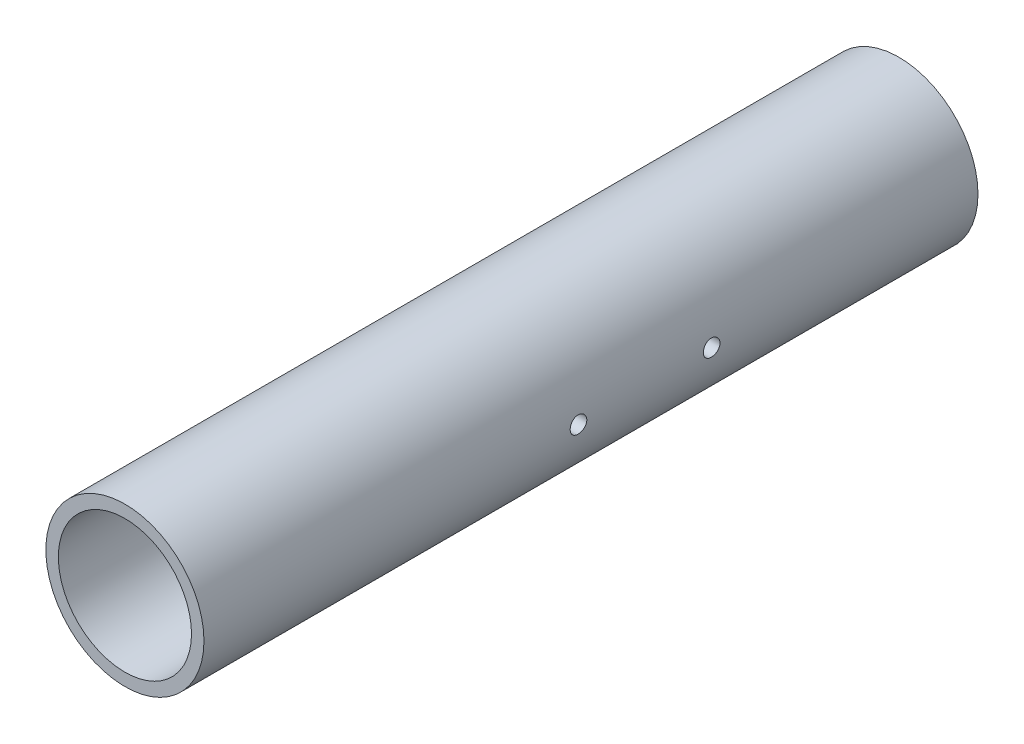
ISO-10303-21;
HEADER;
FILE_DESCRIPTION(('STEP AP214'),'2;1');
FILE_NAME('part.step','',(''),(''),'','','');
FILE_SCHEMA(('AUTOMOTIVE_DESIGN { 1 0 10303 214 1 1 1 1 }'));
ENDSEC;
DATA;
#1=APPLICATION_CONTEXT('core data for automotive mechanical design processes');
#2=APPLICATION_PROTOCOL_DEFINITION('international standard','automotive_design',2000,#1);
#3=PRODUCT_CONTEXT('',#1,'mechanical');
#4=PRODUCT('Part','Part','',(#3));
#5=PRODUCT_RELATED_PRODUCT_CATEGORY('part','',(#4));
#6=PRODUCT_DEFINITION_FORMATION('','',#4);
#7=PRODUCT_DEFINITION_CONTEXT('part definition',#1,'design');
#8=PRODUCT_DEFINITION('design','',#6,#7);
#9=PRODUCT_DEFINITION_SHAPE('','',#8);
#10=(LENGTH_UNIT() NAMED_UNIT(*) SI_UNIT(.MILLI.,.METRE.));
#11=(NAMED_UNIT(*) PLANE_ANGLE_UNIT() SI_UNIT($,.RADIAN.));
#12=(NAMED_UNIT(*) SI_UNIT($,.STERADIAN.) SOLID_ANGLE_UNIT());
#13=UNCERTAINTY_MEASURE_WITH_UNIT(LENGTH_MEASURE(1.E-05),#10,'distance_accuracy_value','');
#14=(GEOMETRIC_REPRESENTATION_CONTEXT(3) GLOBAL_UNCERTAINTY_ASSIGNED_CONTEXT((#13)) GLOBAL_UNIT_ASSIGNED_CONTEXT((#10,
#11,#12)) REPRESENTATION_CONTEXT('',''));
#15=CARTESIAN_POINT('',(0.,0.,0.));
#16=DIRECTION('',(0.,0.,1.));
#17=DIRECTION('',(1.,0.,0.));
#18=AXIS2_PLACEMENT_3D('',#15,#16,#17);
#19=CARTESIAN_POINT('',(0.,0.,295.275));
#20=DIRECTION('',(0.,0.,1.));
#21=DIRECTION('',(1.,0.,0.));
#22=AXIS2_PLACEMENT_3D('',#19,#20,#21);
#23=PLANE('',#22);
#24=CARTESIAN_POINT('',(0.,0.,295.275));
#25=DIRECTION('',(0.,0.,1.));
#26=DIRECTION('',(1.,0.,0.));
#27=AXIS2_PLACEMENT_3D('',#24,#25,#26);
#28=CIRCLE('',#27,30.1625);
#29=CARTESIAN_POINT('',(30.1625,0.,295.275));
#30=VERTEX_POINT('',#29);
#31=EDGE_CURVE('E10',#30,#30,#28,.T.);
#32=ORIENTED_EDGE('',*,*,#31,.T.);
#33=EDGE_LOOP('',(#32));
#34=FACE_BOUND('',#33,.T.);
#35=CARTESIAN_POINT('',(0.,0.,295.275));
#36=DIRECTION('',(0.,0.,1.));
#37=DIRECTION('',(1.,0.,0.));
#38=AXIS2_PLACEMENT_3D('',#35,#36,#37);
#39=CIRCLE('',#38,25.4);
#40=CARTESIAN_POINT('',(25.4,0.,295.275));
#41=VERTEX_POINT('',#40);
#42=EDGE_CURVE('E54',#41,#41,#39,.T.);
#43=ORIENTED_EDGE('',*,*,#42,.F.);
#44=EDGE_LOOP('',(#43));
#45=FACE_BOUND('',#44,.T.);
#46=ADVANCED_FACE('F35',(#34,#45),#23,.T.);
#47=CARTESIAN_POINT('',(0.,0.,0.));
#48=DIRECTION('',(0.,0.,1.));
#49=DIRECTION('',(1.,0.,0.));
#50=AXIS2_PLACEMENT_3D('',#47,#48,#49);
#51=PLANE('',#50);
#52=CARTESIAN_POINT('',(0.,0.,0.));
#53=DIRECTION('',(0.,0.,1.));
#54=DIRECTION('',(1.,0.,0.));
#55=AXIS2_PLACEMENT_3D('',#52,#53,#54);
#56=CIRCLE('',#55,30.1625);
#57=CARTESIAN_POINT('',(30.1625,0.,0.));
#58=VERTEX_POINT('',#57);
#59=EDGE_CURVE('E49',#58,#58,#56,.T.);
#60=ORIENTED_EDGE('',*,*,#59,.F.);
#61=EDGE_LOOP('',(#60));
#62=FACE_BOUND('',#61,.T.);
#63=CARTESIAN_POINT('',(0.,0.,0.));
#64=DIRECTION('',(0.,0.,1.));
#65=DIRECTION('',(1.,0.,0.));
#66=AXIS2_PLACEMENT_3D('',#63,#64,#65);
#67=CIRCLE('',#66,25.4);
#68=CARTESIAN_POINT('',(25.4,0.,0.));
#69=VERTEX_POINT('',#68);
#70=EDGE_CURVE('E57',#69,#69,#67,.T.);
#71=ORIENTED_EDGE('',*,*,#70,.T.);
#72=EDGE_LOOP('',(#71));
#73=FACE_BOUND('',#72,.T.);
#74=ADVANCED_FACE('F116',(#62,#73),#51,.F.);
#75=CARTESIAN_POINT('',(0.,0.,295.275));
#76=DIRECTION('',(0.,0.,-1.));
#77=DIRECTION('',(-1.,0.,0.));
#78=AXIS2_PLACEMENT_3D('',#75,#76,#77);
#79=CYLINDRICAL_SURFACE('',#78,30.1625);
#80=CARTESIAN_POINT('',(-30.1625,0.,155.575));
#81=CARTESIAN_POINT('',(-30.1624978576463,-0.17781336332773,155.57499232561));
#82=CARTESIAN_POINT('',(-30.1609109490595,-0.355743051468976,155.560012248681));
#83=CARTESIAN_POINT('',(-30.1547330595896,-0.706666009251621,155.50048190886));
#84=CARTESIAN_POINT('',(-30.1501388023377,-0.879653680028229,155.455899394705));
#85=CARTESIAN_POINT('',(-30.1384646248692,-1.215560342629,155.33847949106));
#86=CARTESIAN_POINT('',(-30.1313862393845,-1.37848547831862,155.265659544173));
#87=CARTESIAN_POINT('',(-30.1155344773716,-1.6897663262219,155.093866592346));
#88=CARTESIAN_POINT('',(-30.106761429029,-1.83812485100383,154.994898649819));
#89=CARTESIAN_POINT('',(-30.0884635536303,-2.11668421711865,154.773198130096));
#90=CARTESIAN_POINT('',(-30.0789361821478,-2.24681911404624,154.650382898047));
#91=CARTESIAN_POINT('',(-30.0602243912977,-2.48467013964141,154.384650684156));
#92=CARTESIAN_POINT('',(-30.0510399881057,-2.59238521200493,154.241732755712));
#93=CARTESIAN_POINT('',(-30.0340282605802,-2.78257513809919,153.939435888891));
#94=CARTESIAN_POINT('',(-30.0262041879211,-2.86498986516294,153.780018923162));
#95=CARTESIAN_POINT('',(-30.0128310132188,-3.00185572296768,153.449512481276));
#96=CARTESIAN_POINT('',(-30.0072818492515,-3.05630761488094,153.278423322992));
#97=CARTESIAN_POINT('',(-29.9991100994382,-3.13550554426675,152.930104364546));
#98=CARTESIAN_POINT('',(-29.9964766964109,-3.16036140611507,152.752899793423));
#99=CARTESIAN_POINT('',(-29.9944011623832,-3.18000126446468,152.396816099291));
#100=CARTESIAN_POINT('',(-29.9949589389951,-3.17478613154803,152.217937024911));
#101=CARTESIAN_POINT('',(-29.9991928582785,-3.1345224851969,151.864340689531));
#102=CARTESIAN_POINT('',(-30.00285644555,-3.09959408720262,151.689609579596));
#103=CARTESIAN_POINT('',(-30.0128695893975,-3.00108239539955,151.348503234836));
#104=CARTESIAN_POINT('',(-30.0192191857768,-2.93749867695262,151.182128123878));
#105=CARTESIAN_POINT('',(-30.0339033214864,-2.78334933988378,150.862078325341));
#106=CARTESIAN_POINT('',(-30.0422417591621,-2.692730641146,150.708429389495));
#107=CARTESIAN_POINT('',(-30.0599608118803,-2.48712178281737,150.418475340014));
#108=CARTESIAN_POINT('',(-30.0693414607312,-2.37213083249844,150.282170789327));
#109=CARTESIAN_POINT('',(-30.0881439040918,-2.12037176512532,150.030076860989));
#110=CARTESIAN_POINT('',(-30.097565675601,-1.98349995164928,149.914391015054));
#111=CARTESIAN_POINT('',(-30.1153455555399,-1.69222393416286,149.707621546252));
#112=CARTESIAN_POINT('',(-30.1237036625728,-1.53781970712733,149.616537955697));
#113=CARTESIAN_POINT('',(-30.1384176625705,-1.21578854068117,149.461561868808));
#114=CARTESIAN_POINT('',(-30.1447731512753,-1.04815894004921,149.39767486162));
#115=CARTESIAN_POINT('',(-30.1547618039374,-0.704470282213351,149.298982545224));
#116=CARTESIAN_POINT('',(-30.1583950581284,-0.528411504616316,149.264176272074));
#117=CARTESIAN_POINT('',(-30.16251825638,-0.173758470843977,149.224765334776));
#118=CARTESIAN_POINT('',(-30.1630230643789,0.0048197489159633,149.220017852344));
#119=CARTESIAN_POINT('',(-30.1608724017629,0.36022927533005,149.240483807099));
#120=CARTESIAN_POINT('',(-30.1582169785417,0.537060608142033,149.265696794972));
#121=CARTESIAN_POINT('',(-30.1500536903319,0.883542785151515,149.345249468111));
#122=CARTESIAN_POINT('',(-30.1445523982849,1.0532092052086,149.39952204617));
#123=CARTESIAN_POINT('',(-30.1313142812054,1.38103011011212,149.535584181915));
#124=CARTESIAN_POINT('',(-30.1235774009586,1.53918431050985,149.617374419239));
#125=CARTESIAN_POINT('',(-30.1066959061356,1.84013557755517,149.806502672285));
#126=CARTESIAN_POINT('',(-30.0975461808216,1.98287355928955,149.913934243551));
#127=CARTESIAN_POINT('',(-30.0788814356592,2.24834190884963,150.151161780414));
#128=CARTESIAN_POINT('',(-30.0693664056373,2.37107171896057,150.280958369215));
#129=CARTESIAN_POINT('',(-30.0509985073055,2.59353785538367,150.559855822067));
#130=CARTESIAN_POINT('',(-30.0421484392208,2.69318026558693,150.709031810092));
#131=CARTESIAN_POINT('',(-30.0261558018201,2.86599688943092,151.022084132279));
#132=CARTESIAN_POINT('',(-30.0190132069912,2.93917149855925,151.185960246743));
#133=CARTESIAN_POINT('',(-30.0072620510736,3.05681912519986,151.523442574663));
#134=CARTESIAN_POINT('',(-30.0026486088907,3.10134745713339,151.69702932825));
#135=CARTESIAN_POINT('',(-29.9964631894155,3.16061776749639,152.049266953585));
#136=CARTESIAN_POINT('',(-29.994891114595,3.17536070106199,152.227917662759));
#137=CARTESIAN_POINT('',(-29.9949686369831,3.17462764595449,152.584278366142));
#138=CARTESIAN_POINT('',(-29.9966025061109,3.15929918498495,152.76198868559));
#139=CARTESIAN_POINT('',(-30.002874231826,3.09916837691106,153.112294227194));
#140=CARTESIAN_POINT('',(-30.0075120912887,3.05436600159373,153.284889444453));
#141=CARTESIAN_POINT('',(-30.0192647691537,2.93660092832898,153.620060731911));
#142=CARTESIAN_POINT('',(-30.0263791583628,2.86364310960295,153.782638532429));
#143=CARTESIAN_POINT('',(-30.0422841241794,2.69165314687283,154.093265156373));
#144=CARTESIAN_POINT('',(-30.0510746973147,2.59262105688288,154.241314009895));
#145=CARTESIAN_POINT('',(-30.06939324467,2.37074064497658,154.519436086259));
#146=CARTESIAN_POINT('',(-30.0789244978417,2.24778231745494,154.649421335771));
#147=CARTESIAN_POINT('',(-30.0976206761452,1.98176090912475,154.886976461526));
#148=CARTESIAN_POINT('',(-30.1067855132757,1.83869303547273,154.994540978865));
#149=CARTESIAN_POINT('',(-30.1237429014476,1.53607687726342,155.184439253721));
#150=CARTESIAN_POINT('',(-30.1315315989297,1.3764842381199,155.26670262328));
#151=CARTESIAN_POINT('',(-30.144817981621,1.04576812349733,155.403152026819));
#152=CARTESIAN_POINT('',(-30.1503182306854,0.874657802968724,155.457369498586));
#153=CARTESIAN_POINT('',(-30.1570366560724,0.585495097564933,155.522772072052));
#154=CARTESIAN_POINT('',(-30.1590757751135,0.469286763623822,155.542330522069));
#155=CARTESIAN_POINT('',(-30.1618081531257,0.23540261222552,155.568446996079));
#156=CARTESIAN_POINT('',(-30.1625014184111,0.117726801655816,155.575005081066));
#157=CARTESIAN_POINT('',(-30.1625,0.,155.575));
#158=B_SPLINE_CURVE_WITH_KNOTS('',3,(#80,#81,#82,#83,#84,#85,#86,#87,#88,#89,#90,#91,#92,#93,
#94,#95,#96,#97,#98,#99,#100,#101,#102,#103,#104,#105,#106,#107,#108,#109,#110,#111,#112,#113,
#114,#115,#116,#117,#118,#119,#120,#121,#122,#123,#124,#125,#126,#127,#128,#129,#130,#131,#132,
#133,#134,#135,#136,#137,#138,#139,#140,#141,#142,#143,#144,#145,#146,#147,#148,#149,#150,#151,
#152,#153,#154,#155,#156,#157),.UNSPECIFIED.,.T.,.F.,(4,2,2,2,2,2,2,2,2,2,2,2,2,2,2,2,2,2,2,2,2,
2,2,2,2,2,2,2,2,2,2,2,2,2,2,2,2,2,4),(0.,0.53301017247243,1.06660200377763,1.59986475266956,
2.13302433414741,2.66806594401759,3.20313275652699,3.73946149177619,4.27577562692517,
4.81009335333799,5.34439561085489,5.87654816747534,6.40870861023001,6.94192084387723,
7.47515037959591,8.01098626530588,8.54682285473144,9.08276754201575,9.6186944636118,
10.1520731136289,10.6854437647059,11.2175879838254,11.7497453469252,12.2838748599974,
12.818019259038,13.3542997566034,13.8905722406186,14.4258060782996,14.9610227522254,
15.4936202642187,16.0262182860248,16.5587240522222,17.0912287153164,17.6262421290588,
18.1613832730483,18.697999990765,19.2340138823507,19.5869113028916,19.9398070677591),.UNSPECIFIED.);
#159=CARTESIAN_POINT('',(-30.1625,0.,155.575));
#160=VERTEX_POINT('',#159);
#161=EDGE_CURVE('E105',#160,#160,#158,.T.);
#162=ORIENTED_EDGE('',*,*,#161,.T.);
#163=EDGE_LOOP('',(#162));
#164=FACE_BOUND('',#163,.T.);
#165=CARTESIAN_POINT('',(30.1625,0.,149.225));
#166=CARTESIAN_POINT('',(30.1624978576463,-0.17781336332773,149.22500767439));
#167=CARTESIAN_POINT('',(30.1609109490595,-0.355743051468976,149.239987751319));
#168=CARTESIAN_POINT('',(30.1547330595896,-0.706666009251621,149.29951809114));
#169=CARTESIAN_POINT('',(30.1501388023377,-0.879653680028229,149.344100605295));
#170=CARTESIAN_POINT('',(30.1384646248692,-1.215560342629,149.46152050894));
#171=CARTESIAN_POINT('',(30.1313862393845,-1.37848547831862,149.534340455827));
#172=CARTESIAN_POINT('',(30.1155344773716,-1.6897663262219,149.706133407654));
#173=CARTESIAN_POINT('',(30.106761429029,-1.83812485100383,149.805101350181));
#174=CARTESIAN_POINT('',(30.0884635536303,-2.11668421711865,150.026801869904));
#175=CARTESIAN_POINT('',(30.0789361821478,-2.24681911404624,150.149617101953));
#176=CARTESIAN_POINT('',(30.0602243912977,-2.48467013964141,150.415349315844));
#177=CARTESIAN_POINT('',(30.0510399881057,-2.59238521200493,150.558267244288));
#178=CARTESIAN_POINT('',(30.0340282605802,-2.78257513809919,150.860564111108));
#179=CARTESIAN_POINT('',(30.0262041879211,-2.86498986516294,151.019981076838));
#180=CARTESIAN_POINT('',(30.0128310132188,-3.00185572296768,151.350487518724));
#181=CARTESIAN_POINT('',(30.0072818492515,-3.05630761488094,151.521576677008));
#182=CARTESIAN_POINT('',(29.9991100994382,-3.13550554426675,151.869895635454));
#183=CARTESIAN_POINT('',(29.9964766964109,-3.16036140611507,152.047100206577));
#184=CARTESIAN_POINT('',(29.9944011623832,-3.18000126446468,152.403183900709));
#185=CARTESIAN_POINT('',(29.9949589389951,-3.17478613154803,152.582062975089));
#186=CARTESIAN_POINT('',(29.9991928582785,-3.1345224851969,152.935659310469));
#187=CARTESIAN_POINT('',(30.00285644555,-3.09959408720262,153.110390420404));
#188=CARTESIAN_POINT('',(30.0128695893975,-3.00108239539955,153.451496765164));
#189=CARTESIAN_POINT('',(30.0192191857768,-2.93749867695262,153.617871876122));
#190=CARTESIAN_POINT('',(30.0339033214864,-2.78334933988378,153.937921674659));
#191=CARTESIAN_POINT('',(30.0422417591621,-2.692730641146,154.091570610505));
#192=CARTESIAN_POINT('',(30.0599608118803,-2.48712178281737,154.381524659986));
#193=CARTESIAN_POINT('',(30.0693414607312,-2.37213083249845,154.517829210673));
#194=CARTESIAN_POINT('',(30.0881439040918,-2.12037176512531,154.769923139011));
#195=CARTESIAN_POINT('',(30.097565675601,-1.98349995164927,154.885608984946));
#196=CARTESIAN_POINT('',(30.1153455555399,-1.69222393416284,155.092378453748));
#197=CARTESIAN_POINT('',(30.1237036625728,-1.53781970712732,155.183462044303));
#198=CARTESIAN_POINT('',(30.1384176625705,-1.21578854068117,155.338438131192));
#199=CARTESIAN_POINT('',(30.1447731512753,-1.04815894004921,155.40232513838));
#200=CARTESIAN_POINT('',(30.1547618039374,-0.704470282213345,155.501017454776));
#201=CARTESIAN_POINT('',(30.1583950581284,-0.528411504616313,155.535823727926));
#202=CARTESIAN_POINT('',(30.16251825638,-0.173758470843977,155.575234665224));
#203=CARTESIAN_POINT('',(30.1630230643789,0.00481974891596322,155.579982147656));
#204=CARTESIAN_POINT('',(30.1608724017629,0.36022927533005,155.559516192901));
#205=CARTESIAN_POINT('',(30.1582169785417,0.537060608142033,155.534303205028));
#206=CARTESIAN_POINT('',(30.1500536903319,0.883542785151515,155.454750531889));
#207=CARTESIAN_POINT('',(30.1445523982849,1.0532092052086,155.40047795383));
#208=CARTESIAN_POINT('',(30.1313142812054,1.38103011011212,155.264415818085));
#209=CARTESIAN_POINT('',(30.1235774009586,1.53918431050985,155.182625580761));
#210=CARTESIAN_POINT('',(30.1066959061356,1.84013557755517,154.993497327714));
#211=CARTESIAN_POINT('',(30.0975461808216,1.98287355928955,154.886065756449));
#212=CARTESIAN_POINT('',(30.0788814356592,2.24834190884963,154.648838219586));
#213=CARTESIAN_POINT('',(30.0693664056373,2.37107171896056,154.519041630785));
#214=CARTESIAN_POINT('',(30.0509985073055,2.59353785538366,154.240144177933));
#215=CARTESIAN_POINT('',(30.0421484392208,2.69318026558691,154.090968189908));
#216=CARTESIAN_POINT('',(30.0261558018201,2.8659968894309,153.777915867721));
#217=CARTESIAN_POINT('',(30.0190132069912,2.93917149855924,153.614039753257));
#218=CARTESIAN_POINT('',(30.0072620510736,3.05681912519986,153.276557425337));
#219=CARTESIAN_POINT('',(30.0026486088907,3.10134745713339,153.10297067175));
#220=CARTESIAN_POINT('',(29.9964631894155,3.16061776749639,152.750733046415));
#221=CARTESIAN_POINT('',(29.994891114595,3.17536070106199,152.572082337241));
#222=CARTESIAN_POINT('',(29.9949686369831,3.17462764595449,152.215721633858));
#223=CARTESIAN_POINT('',(29.9966025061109,3.15929918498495,152.03801131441));
#224=CARTESIAN_POINT('',(30.002874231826,3.09916837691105,151.687705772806));
#225=CARTESIAN_POINT('',(30.0075120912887,3.05436600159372,151.515110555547));
#226=CARTESIAN_POINT('',(30.0192647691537,2.93660092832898,151.179939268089));
#227=CARTESIAN_POINT('',(30.0263791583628,2.86364310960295,151.017361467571));
#228=CARTESIAN_POINT('',(30.0422841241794,2.69165314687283,150.706734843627));
#229=CARTESIAN_POINT('',(30.0510746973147,2.59262105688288,150.558685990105));
#230=CARTESIAN_POINT('',(30.06939324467,2.37074064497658,150.280563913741));
#231=CARTESIAN_POINT('',(30.0789244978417,2.24778231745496,150.150578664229));
#232=CARTESIAN_POINT('',(30.0976206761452,1.98176090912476,149.913023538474));
#233=CARTESIAN_POINT('',(30.1067855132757,1.83869303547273,149.805459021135));
#234=CARTESIAN_POINT('',(30.1237429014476,1.53607687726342,149.615560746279));
#235=CARTESIAN_POINT('',(30.1315315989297,1.3764842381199,149.53329737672));
#236=CARTESIAN_POINT('',(30.144817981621,1.04576812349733,149.396847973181));
#237=CARTESIAN_POINT('',(30.1503182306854,0.874657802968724,149.342630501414));
#238=CARTESIAN_POINT('',(30.1570366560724,0.585495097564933,149.277227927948));
#239=CARTESIAN_POINT('',(30.1590757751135,0.469286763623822,149.257669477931));
#240=CARTESIAN_POINT('',(30.1618081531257,0.23540261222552,149.231553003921));
#241=CARTESIAN_POINT('',(30.1625014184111,0.117726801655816,149.224994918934));
#242=CARTESIAN_POINT('',(30.1625,0.,149.225));
#243=B_SPLINE_CURVE_WITH_KNOTS('',3,(#165,#166,#167,#168,#169,#170,#171,#172,#173,#174,#175,
#176,#177,#178,#179,#180,#181,#182,#183,#184,#185,#186,#187,#188,#189,#190,#191,#192,#193,#194,
#195,#196,#197,#198,#199,#200,#201,#202,#203,#204,#205,#206,#207,#208,#209,#210,#211,#212,#213,
#214,#215,#216,#217,#218,#219,#220,#221,#222,#223,#224,#225,#226,#227,#228,#229,#230,#231,#232,
#233,#234,#235,#236,#237,#238,#239,#240,#241,#242),.UNSPECIFIED.,.T.,.F.,(4,2,2,2,2,2,2,2,2,2,2,
2,2,2,2,2,2,2,2,2,2,2,2,2,2,2,2,2,2,2,2,2,2,2,2,2,2,2,4),(0.,0.53301017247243,1.06660200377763,
1.59986475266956,2.13302433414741,2.66806594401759,3.20313275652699,3.73946149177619,
4.27577562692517,4.81009335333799,5.34439561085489,5.87654816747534,6.40870861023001,
6.94192084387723,7.47515037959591,8.0109862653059,8.54682285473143,9.08276754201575,
9.61869446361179,10.1520731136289,10.6854437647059,11.2175879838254,11.7497453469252,
12.2838748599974,12.818019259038,13.3542997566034,13.8905722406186,14.4258060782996,
14.9610227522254,15.4936202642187,16.0262182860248,16.5587240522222,17.0912287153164,
17.6262421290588,18.1613832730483,18.697999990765,19.2340138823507,19.5869113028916,
19.9398070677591),.UNSPECIFIED.);
#244=CARTESIAN_POINT('',(30.1625,0.,149.225));
#245=VERTEX_POINT('',#244);
#246=EDGE_CURVE('E99',#245,#245,#243,.T.);
#247=ORIENTED_EDGE('',*,*,#246,.T.);
#248=EDGE_LOOP('',(#247));
#249=FACE_BOUND('',#248,.T.);
#250=CARTESIAN_POINT('',(-30.1625,0.,104.775));
#251=CARTESIAN_POINT('',(-30.1624978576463,-0.177813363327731,104.77499232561));
#252=CARTESIAN_POINT('',(-30.1609109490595,-0.355743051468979,104.760012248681));
#253=CARTESIAN_POINT('',(-30.1547330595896,-0.706666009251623,104.70048190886));
#254=CARTESIAN_POINT('',(-30.1501388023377,-0.879653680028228,104.655899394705));
#255=CARTESIAN_POINT('',(-30.1384646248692,-1.215560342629,104.53847949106));
#256=CARTESIAN_POINT('',(-30.1313862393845,-1.37848547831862,104.465659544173));
#257=CARTESIAN_POINT('',(-30.1155344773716,-1.68976632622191,104.293866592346));
#258=CARTESIAN_POINT('',(-30.106761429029,-1.83812485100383,104.194898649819));
#259=CARTESIAN_POINT('',(-30.0884635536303,-2.11668421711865,103.973198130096));
#260=CARTESIAN_POINT('',(-30.0789361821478,-2.24681911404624,103.850382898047));
#261=CARTESIAN_POINT('',(-30.0602243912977,-2.4846701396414,103.584650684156));
#262=CARTESIAN_POINT('',(-30.0510399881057,-2.59238521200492,103.441732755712));
#263=CARTESIAN_POINT('',(-30.0340282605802,-2.78257513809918,103.139435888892));
#264=CARTESIAN_POINT('',(-30.0262041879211,-2.86498986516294,102.980018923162));
#265=CARTESIAN_POINT('',(-30.0128310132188,-3.00185572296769,102.649512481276));
#266=CARTESIAN_POINT('',(-30.0072818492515,-3.05630761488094,102.478423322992));
#267=CARTESIAN_POINT('',(-29.9991100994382,-3.13550554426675,102.130104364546));
#268=CARTESIAN_POINT('',(-29.9964766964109,-3.16036140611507,101.952899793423));
#269=CARTESIAN_POINT('',(-29.9944011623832,-3.18000126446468,101.596816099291));
#270=CARTESIAN_POINT('',(-29.9949589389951,-3.17478613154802,101.417937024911));
#271=CARTESIAN_POINT('',(-29.9991928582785,-3.1345224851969,101.064340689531));
#272=CARTESIAN_POINT('',(-30.00285644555,-3.09959408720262,100.889609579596));
#273=CARTESIAN_POINT('',(-30.0128695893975,-3.00108239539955,100.548503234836));
#274=CARTESIAN_POINT('',(-30.0192191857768,-2.93749867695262,100.382128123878));
#275=CARTESIAN_POINT('',(-30.0339033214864,-2.78334933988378,100.062078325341));
#276=CARTESIAN_POINT('',(-30.0422417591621,-2.69273064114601,99.9084293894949));
#277=CARTESIAN_POINT('',(-30.0599608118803,-2.48712178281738,99.6184753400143));
#278=CARTESIAN_POINT('',(-30.0693414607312,-2.37213083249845,99.482170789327));
#279=CARTESIAN_POINT('',(-30.0881439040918,-2.12037176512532,99.2300768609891));
#280=CARTESIAN_POINT('',(-30.097565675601,-1.98349995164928,99.1143910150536));
#281=CARTESIAN_POINT('',(-30.1153455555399,-1.69222393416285,98.9076215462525));
#282=CARTESIAN_POINT('',(-30.1237036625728,-1.53781970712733,98.8165379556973));
#283=CARTESIAN_POINT('',(-30.1384176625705,-1.21578854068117,98.6615618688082));
#284=CARTESIAN_POINT('',(-30.1447731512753,-1.0481589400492,98.5976748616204));
#285=CARTESIAN_POINT('',(-30.1547618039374,-0.704470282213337,98.4989825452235));
#286=CARTESIAN_POINT('',(-30.1583950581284,-0.528411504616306,98.464176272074));
#287=CARTESIAN_POINT('',(-30.16251825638,-0.173758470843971,98.4247653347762));
#288=CARTESIAN_POINT('',(-30.1630230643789,0.00481974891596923,98.420017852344));
#289=CARTESIAN_POINT('',(-30.1608724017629,0.360229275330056,98.4404838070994));
#290=CARTESIAN_POINT('',(-30.1582169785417,0.537060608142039,98.4656967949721));
#291=CARTESIAN_POINT('',(-30.1500536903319,0.883542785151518,98.5452494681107));
#292=CARTESIAN_POINT('',(-30.1445523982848,1.0532092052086,98.5995220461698));
#293=CARTESIAN_POINT('',(-30.1313142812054,1.38103011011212,98.7355841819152));
#294=CARTESIAN_POINT('',(-30.1235774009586,1.53918431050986,98.8173744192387));
#295=CARTESIAN_POINT('',(-30.1066959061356,1.84013557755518,99.0065026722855));
#296=CARTESIAN_POINT('',(-30.0975461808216,1.98287355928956,99.1139342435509));
#297=CARTESIAN_POINT('',(-30.0788814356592,2.24834190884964,99.3511617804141));
#298=CARTESIAN_POINT('',(-30.0693664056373,2.37107171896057,99.4809583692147));
#299=CARTESIAN_POINT('',(-30.0509985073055,2.59353785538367,99.7598558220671));
#300=CARTESIAN_POINT('',(-30.0421484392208,2.69318026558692,99.9090318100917));
#301=CARTESIAN_POINT('',(-30.0261558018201,2.86599688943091,100.222084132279));
#302=CARTESIAN_POINT('',(-30.0190132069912,2.93917149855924,100.385960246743));
#303=CARTESIAN_POINT('',(-30.0072620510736,3.05681912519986,100.723442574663));
#304=CARTESIAN_POINT('',(-30.0026486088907,3.10134745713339,100.89702932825));
#305=CARTESIAN_POINT('',(-29.9964631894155,3.16061776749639,101.249266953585));
#306=CARTESIAN_POINT('',(-29.994891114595,3.17536070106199,101.427917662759));
#307=CARTESIAN_POINT('',(-29.9949686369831,3.17462764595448,101.784278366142));
#308=CARTESIAN_POINT('',(-29.9966025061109,3.15929918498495,101.96198868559));
#309=CARTESIAN_POINT('',(-30.002874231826,3.09916837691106,102.312294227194));
#310=CARTESIAN_POINT('',(-30.0075120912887,3.05436600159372,102.484889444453));
#311=CARTESIAN_POINT('',(-30.0192647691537,2.93660092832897,102.820060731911));
#312=CARTESIAN_POINT('',(-30.0263791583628,2.86364310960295,102.982638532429));
#313=CARTESIAN_POINT('',(-30.0422841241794,2.69165314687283,103.293265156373));
#314=CARTESIAN_POINT('',(-30.0510746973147,2.59262105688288,103.441314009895));
#315=CARTESIAN_POINT('',(-30.06939324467,2.37074064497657,103.719436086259));
#316=CARTESIAN_POINT('',(-30.0789244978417,2.24778231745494,103.849421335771));
#317=CARTESIAN_POINT('',(-30.0976206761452,1.98176090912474,104.086976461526));
#318=CARTESIAN_POINT('',(-30.1067855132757,1.83869303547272,104.194540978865));
#319=CARTESIAN_POINT('',(-30.1237429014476,1.53607687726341,104.384439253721));
#320=CARTESIAN_POINT('',(-30.1315315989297,1.37648423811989,104.46670262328));
#321=CARTESIAN_POINT('',(-30.144817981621,1.04576812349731,104.603152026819));
#322=CARTESIAN_POINT('',(-30.1503182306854,0.874657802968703,104.657369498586));
#323=CARTESIAN_POINT('',(-30.1570366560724,0.585495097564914,104.722772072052));
#324=CARTESIAN_POINT('',(-30.1590757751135,0.469286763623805,104.742330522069));
#325=CARTESIAN_POINT('',(-30.1618081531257,0.23540261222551,104.768446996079));
#326=CARTESIAN_POINT('',(-30.1625014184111,0.117726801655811,104.775005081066));
#327=CARTESIAN_POINT('',(-30.1625,0.,104.775));
#328=B_SPLINE_CURVE_WITH_KNOTS('',3,(#250,#251,#252,#253,#254,#255,#256,#257,#258,#259,#260,
#261,#262,#263,#264,#265,#266,#267,#268,#269,#270,#271,#272,#273,#274,#275,#276,#277,#278,#279,
#280,#281,#282,#283,#284,#285,#286,#287,#288,#289,#290,#291,#292,#293,#294,#295,#296,#297,#298,
#299,#300,#301,#302,#303,#304,#305,#306,#307,#308,#309,#310,#311,#312,#313,#314,#315,#316,#317,
#318,#319,#320,#321,#322,#323,#324,#325,#326,#327),.UNSPECIFIED.,.T.,.F.,(4,2,2,2,2,2,2,2,2,2,2,
2,2,2,2,2,2,2,2,2,2,2,2,2,2,2,2,2,2,2,2,2,2,2,2,2,2,2,4),(0.,0.533010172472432,1.06660200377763,
1.59986475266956,2.13302433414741,2.66806594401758,3.20313275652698,3.73946149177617,
4.27577562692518,4.810093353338,5.34439561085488,5.87654816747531,6.40870861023,
6.94192084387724,7.47515037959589,8.01098626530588,8.54682285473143,9.08276754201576,
9.6186944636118,10.1520731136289,10.6854437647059,11.2175879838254,11.7497453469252,
12.2838748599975,12.818019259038,13.3542997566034,13.8905722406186,14.4258060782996,
14.9610227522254,15.4936202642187,16.0262182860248,16.5587240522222,17.0912287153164,
17.6262421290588,18.1613832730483,18.697999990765,19.2340138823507,19.5869113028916,
19.9398070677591),.UNSPECIFIED.);
#329=CARTESIAN_POINT('',(-30.1625,0.,104.775));
#330=VERTEX_POINT('',#329);
#331=EDGE_CURVE('E92',#330,#330,#328,.T.);
#332=ORIENTED_EDGE('',*,*,#331,.T.);
#333=EDGE_LOOP('',(#332));
#334=FACE_BOUND('',#333,.T.);
#335=CARTESIAN_POINT('',(30.1625,0.,98.425));
#336=CARTESIAN_POINT('',(30.1624978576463,-0.177813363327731,98.4250076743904));
#337=CARTESIAN_POINT('',(30.1609109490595,-0.355743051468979,98.4399877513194));
#338=CARTESIAN_POINT('',(30.1547330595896,-0.706666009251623,98.4995180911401));
#339=CARTESIAN_POINT('',(30.1501388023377,-0.879653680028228,98.5441006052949));
#340=CARTESIAN_POINT('',(30.1384646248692,-1.215560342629,98.6615205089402));
#341=CARTESIAN_POINT('',(30.1313862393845,-1.37848547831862,98.734340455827));
#342=CARTESIAN_POINT('',(30.1155344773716,-1.68976632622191,98.9061334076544));
#343=CARTESIAN_POINT('',(30.106761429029,-1.83812485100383,99.0051013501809));
#344=CARTESIAN_POINT('',(30.0884635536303,-2.11668421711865,99.226801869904));
#345=CARTESIAN_POINT('',(30.0789361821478,-2.24681911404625,99.3496171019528));
#346=CARTESIAN_POINT('',(30.0602243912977,-2.4846701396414,99.6153493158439));
#347=CARTESIAN_POINT('',(30.0510399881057,-2.59238521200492,99.758267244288));
#348=CARTESIAN_POINT('',(30.0340282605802,-2.78257513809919,100.060564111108));
#349=CARTESIAN_POINT('',(30.0262041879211,-2.86498986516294,100.219981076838));
#350=CARTESIAN_POINT('',(30.0128310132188,-3.00185572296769,100.550487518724));
#351=CARTESIAN_POINT('',(30.0072818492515,-3.05630761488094,100.721576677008));
#352=CARTESIAN_POINT('',(29.9991100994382,-3.13550554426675,101.069895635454));
#353=CARTESIAN_POINT('',(29.9964766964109,-3.16036140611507,101.247100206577));
#354=CARTESIAN_POINT('',(29.9944011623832,-3.18000126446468,101.603183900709));
#355=CARTESIAN_POINT('',(29.9949589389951,-3.17478613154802,101.782062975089));
#356=CARTESIAN_POINT('',(29.9991928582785,-3.1345224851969,102.135659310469));
#357=CARTESIAN_POINT('',(30.00285644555,-3.09959408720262,102.310390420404));
#358=CARTESIAN_POINT('',(30.0128695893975,-3.00108239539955,102.651496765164));
#359=CARTESIAN_POINT('',(30.0192191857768,-2.93749867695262,102.817871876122));
#360=CARTESIAN_POINT('',(30.0339033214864,-2.78334933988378,103.137921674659));
#361=CARTESIAN_POINT('',(30.0422417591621,-2.692730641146,103.291570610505));
#362=CARTESIAN_POINT('',(30.0599608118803,-2.48712178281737,103.581524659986));
#363=CARTESIAN_POINT('',(30.0693414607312,-2.37213083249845,103.717829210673));
#364=CARTESIAN_POINT('',(30.0881439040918,-2.12037176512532,103.969923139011));
#365=CARTESIAN_POINT('',(30.097565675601,-1.98349995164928,104.085608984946));
#366=CARTESIAN_POINT('',(30.1153455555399,-1.69222393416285,104.292378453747));
#367=CARTESIAN_POINT('',(30.1237036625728,-1.53781970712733,104.383462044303));
#368=CARTESIAN_POINT('',(30.1384176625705,-1.21578854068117,104.538438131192));
#369=CARTESIAN_POINT('',(30.1447731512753,-1.0481589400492,104.60232513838));
#370=CARTESIAN_POINT('',(30.1547618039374,-0.704470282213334,104.701017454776));
#371=CARTESIAN_POINT('',(30.1583950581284,-0.528411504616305,104.735823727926));
#372=CARTESIAN_POINT('',(30.16251825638,-0.173758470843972,104.775234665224));
#373=CARTESIAN_POINT('',(30.1630230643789,0.00481974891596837,104.779982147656));
#374=CARTESIAN_POINT('',(30.1608724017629,0.360229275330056,104.759516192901));
#375=CARTESIAN_POINT('',(30.1582169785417,0.53706060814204,104.734303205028));
#376=CARTESIAN_POINT('',(30.1500536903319,0.88354278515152,104.654750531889));
#377=CARTESIAN_POINT('',(30.1445523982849,1.0532092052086,104.60047795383));
#378=CARTESIAN_POINT('',(30.1313142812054,1.38103011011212,104.464415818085));
#379=CARTESIAN_POINT('',(30.1235774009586,1.53918431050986,104.382625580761));
#380=CARTESIAN_POINT('',(30.1066959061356,1.84013557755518,104.193497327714));
#381=CARTESIAN_POINT('',(30.0975461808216,1.98287355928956,104.086065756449));
#382=CARTESIAN_POINT('',(30.0788814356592,2.24834190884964,103.848838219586));
#383=CARTESIAN_POINT('',(30.0693664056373,2.37107171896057,103.719041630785));
#384=CARTESIAN_POINT('',(30.0509985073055,2.59353785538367,103.440144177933));
#385=CARTESIAN_POINT('',(30.0421484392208,2.69318026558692,103.290968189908));
#386=CARTESIAN_POINT('',(30.0261558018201,2.86599688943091,102.977915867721));
#387=CARTESIAN_POINT('',(30.0190132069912,2.93917149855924,102.814039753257));
#388=CARTESIAN_POINT('',(30.0072620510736,3.05681912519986,102.476557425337));
#389=CARTESIAN_POINT('',(30.0026486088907,3.10134745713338,102.30297067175));
#390=CARTESIAN_POINT('',(29.9964631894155,3.16061776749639,101.950733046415));
#391=CARTESIAN_POINT('',(29.994891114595,3.17536070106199,101.772082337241));
#392=CARTESIAN_POINT('',(29.9949686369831,3.17462764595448,101.415721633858));
#393=CARTESIAN_POINT('',(29.9966025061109,3.15929918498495,101.23801131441));
#394=CARTESIAN_POINT('',(30.002874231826,3.09916837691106,100.887705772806));
#395=CARTESIAN_POINT('',(30.0075120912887,3.05436600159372,100.715110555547));
#396=CARTESIAN_POINT('',(30.0192647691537,2.93660092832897,100.379939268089));
#397=CARTESIAN_POINT('',(30.0263791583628,2.86364310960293,100.217361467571));
#398=CARTESIAN_POINT('',(30.0422841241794,2.69165314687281,99.9067348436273));
#399=CARTESIAN_POINT('',(30.0510746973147,2.59262105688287,99.7586859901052));
#400=CARTESIAN_POINT('',(30.06939324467,2.37074064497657,99.4805639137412));
#401=CARTESIAN_POINT('',(30.0789244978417,2.24778231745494,99.3505786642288));
#402=CARTESIAN_POINT('',(30.0976206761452,1.98176090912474,99.1130235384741));
#403=CARTESIAN_POINT('',(30.1067855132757,1.83869303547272,99.0054590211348));
#404=CARTESIAN_POINT('',(30.1237429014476,1.53607687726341,98.8155607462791));
#405=CARTESIAN_POINT('',(30.1315315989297,1.37648423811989,98.7332973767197));
#406=CARTESIAN_POINT('',(30.144817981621,1.04576812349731,98.5968479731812));
#407=CARTESIAN_POINT('',(30.1503182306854,0.874657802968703,98.5426305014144));
#408=CARTESIAN_POINT('',(30.1570366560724,0.585495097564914,98.4772279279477));
#409=CARTESIAN_POINT('',(30.1590757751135,0.469286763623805,98.457669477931));
#410=CARTESIAN_POINT('',(30.1618081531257,0.23540261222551,98.4315530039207));
#411=CARTESIAN_POINT('',(30.1625014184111,0.117726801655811,98.424994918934));
#412=CARTESIAN_POINT('',(30.1625,0.,98.425));
#413=B_SPLINE_CURVE_WITH_KNOTS('',3,(#335,#336,#337,#338,#339,#340,#341,#342,#343,#344,#345,
#346,#347,#348,#349,#350,#351,#352,#353,#354,#355,#356,#357,#358,#359,#360,#361,#362,#363,#364,
#365,#366,#367,#368,#369,#370,#371,#372,#373,#374,#375,#376,#377,#378,#379,#380,#381,#382,#383,
#384,#385,#386,#387,#388,#389,#390,#391,#392,#393,#394,#395,#396,#397,#398,#399,#400,#401,#402,
#403,#404,#405,#406,#407,#408,#409,#410,#411,#412),.UNSPECIFIED.,.T.,.F.,(4,2,2,2,2,2,2,2,2,2,2,
2,2,2,2,2,2,2,2,2,2,2,2,2,2,2,2,2,2,2,2,2,2,2,2,2,2,2,4),(0.,0.533010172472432,1.06660200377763,
1.59986475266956,2.13302433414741,2.6680659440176,3.20313275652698,3.73946149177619,
4.27577562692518,4.81009335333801,5.34439561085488,5.87654816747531,6.40870861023,
6.94192084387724,7.47515037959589,8.01098626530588,8.54682285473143,9.08276754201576,
9.6186944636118,10.1520731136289,10.6854437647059,11.2175879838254,11.7497453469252,
12.2838748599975,12.818019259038,13.3542997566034,13.8905722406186,14.4258060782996,
14.9610227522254,15.4936202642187,16.0262182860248,16.5587240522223,17.0912287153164,
17.6262421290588,18.1613832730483,18.697999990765,19.2340138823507,19.5869113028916,
19.9398070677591),.UNSPECIFIED.);
#414=CARTESIAN_POINT('',(30.1625,0.,98.425));
#415=VERTEX_POINT('',#414);
#416=EDGE_CURVE('E87',#415,#415,#413,.T.);
#417=ORIENTED_EDGE('',*,*,#416,.T.);
#418=EDGE_LOOP('',(#417));
#419=FACE_BOUND('',#418,.T.);
#420=ORIENTED_EDGE('',*,*,#31,.F.);
#421=EDGE_LOOP('',(#420));
#422=FACE_BOUND('',#421,.T.);
#423=ORIENTED_EDGE('',*,*,#59,.T.);
#424=EDGE_LOOP('',(#423));
#425=FACE_BOUND('',#424,.T.);
#426=ADVANCED_FACE('F37',(#164,#249,#334,#419,#422,#425),#79,.T.);
#427=CARTESIAN_POINT('',(0.,0.,295.275));
#428=DIRECTION('',(0.,0.,-1.));
#429=DIRECTION('',(-1.,0.,0.));
#430=AXIS2_PLACEMENT_3D('',#427,#428,#429);
#431=CYLINDRICAL_SURFACE('',#430,25.4);
#432=CARTESIAN_POINT('',(-25.4,0.,155.575));
#433=CARTESIAN_POINT('',(-25.3999975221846,-0.177598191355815,155.574992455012));
#434=CARTESIAN_POINT('',(-25.3981176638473,-0.355307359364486,155.560048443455));
#435=CARTESIAN_POINT('',(-25.3907993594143,-0.705780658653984,155.500669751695));
#436=CARTESIAN_POINT('',(-25.3853571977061,-0.878539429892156,155.456204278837));
#437=CARTESIAN_POINT('',(-25.371527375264,-1.21398738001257,155.339113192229));
#438=CARTESIAN_POINT('',(-25.3631416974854,-1.37668325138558,155.266506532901));
#439=CARTESIAN_POINT('',(-25.3443575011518,-1.68754993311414,155.095235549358));
#440=CARTESIAN_POINT('',(-25.3339593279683,-1.83572322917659,154.996575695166));
#441=CARTESIAN_POINT('',(-25.3122470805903,-2.11418527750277,154.775418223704));
#442=CARTESIAN_POINT('',(-25.3009287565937,-2.24438256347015,154.65280584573));
#443=CARTESIAN_POINT('',(-25.2786861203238,-2.48240904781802,154.387470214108));
#444=CARTESIAN_POINT('',(-25.2677618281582,-2.59023710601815,154.24474593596));
#445=CARTESIAN_POINT('',(-25.2475022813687,-2.7808049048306,153.942643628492));
#446=CARTESIAN_POINT('',(-25.2381725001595,-2.86345896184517,153.783211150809));
#447=CARTESIAN_POINT('',(-25.2222143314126,-3.0007853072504,153.452592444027));
#448=CARTESIAN_POINT('',(-25.2155858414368,-3.05545865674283,153.281406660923));
#449=CARTESIAN_POINT('',(-25.2058213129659,-3.13499370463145,152.933089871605));
#450=CARTESIAN_POINT('',(-25.2026671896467,-3.16000982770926,152.755994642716));
#451=CARTESIAN_POINT('',(-25.2001531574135,-3.17999814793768,152.400093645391));
#452=CARTESIAN_POINT('',(-25.2007930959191,-3.17497155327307,152.221287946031));
#453=CARTESIAN_POINT('',(-25.2057783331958,-3.13514389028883,151.868117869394));
#454=CARTESIAN_POINT('',(-25.2101024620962,-3.10051292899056,151.693733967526));
#455=CARTESIAN_POINT('',(-25.2219358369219,-3.0027249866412,151.353272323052));
#456=CARTESIAN_POINT('',(-25.2294451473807,-2.93956742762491,151.187194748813));
#457=CARTESIAN_POINT('',(-25.2468267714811,-2.78633626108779,150.867531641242));
#458=CARTESIAN_POINT('',(-25.2567055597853,-2.69618873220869,150.713981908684));
#459=CARTESIAN_POINT('',(-25.2777080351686,-2.49158946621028,150.424125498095));
#460=CARTESIAN_POINT('',(-25.2888317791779,-2.37713661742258,150.287819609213));
#461=CARTESIAN_POINT('',(-25.3111648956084,-2.1262328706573,150.035332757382));
#462=CARTESIAN_POINT('',(-25.3223743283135,-1.98963534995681,149.919297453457));
#463=CARTESIAN_POINT('',(-25.3435438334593,-1.69882460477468,149.711779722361));
#464=CARTESIAN_POINT('',(-25.3535039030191,-1.54461133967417,149.620297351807));
#465=CARTESIAN_POINT('',(-25.371058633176,-1.22283432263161,149.464482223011));
#466=CARTESIAN_POINT('',(-25.3786524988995,-1.05526610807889,149.400158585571));
#467=CARTESIAN_POINT('',(-25.3906119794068,-0.711591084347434,149.300602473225));
#468=CARTESIAN_POINT('',(-25.3949777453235,-0.53548467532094,149.265368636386));
#469=CARTESIAN_POINT('',(-25.3999694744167,-0.180991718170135,149.225181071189));
#470=CARTESIAN_POINT('',(-25.4006202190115,-0.00262825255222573,149.220026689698));
#471=CARTESIAN_POINT('',(-25.398175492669,0.352419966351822,149.239614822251));
#472=CARTESIAN_POINT('',(-25.3950801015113,0.529104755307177,149.264356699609));
#473=CARTESIAN_POINT('',(-25.38550636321,0.875188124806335,149.342868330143));
#474=CARTESIAN_POINT('',(-25.3790391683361,1.04460874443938,149.396542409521));
#475=CARTESIAN_POINT('',(-25.3634458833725,1.37204406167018,149.531295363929));
#476=CARTESIAN_POINT('',(-25.3543197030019,1.53005837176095,149.612375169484));
#477=CARTESIAN_POINT('',(-25.3343641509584,1.83109174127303,149.800123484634));
#478=CARTESIAN_POINT('',(-25.3235262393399,1.97402927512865,149.906921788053));
#479=CARTESIAN_POINT('',(-25.3013863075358,2.24002217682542,150.142891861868));
#480=CARTESIAN_POINT('',(-25.2900842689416,2.36307675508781,150.272064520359));
#481=CARTESIAN_POINT('',(-25.2682134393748,2.58652258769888,150.550000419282));
#482=CARTESIAN_POINT('',(-25.2576491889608,2.68678083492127,150.698870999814));
#483=CARTESIAN_POINT('',(-25.2385247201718,2.86086916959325,151.011455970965));
#484=CARTESIAN_POINT('',(-25.229964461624,2.93469978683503,151.175170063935));
#485=CARTESIAN_POINT('',(-25.215848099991,3.05362175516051,151.512365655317));
#486=CARTESIAN_POINT('',(-25.2102841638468,3.09878809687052,151.685820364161));
#487=CARTESIAN_POINT('',(-25.2027679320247,3.15934089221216,152.037926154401));
#488=CARTESIAN_POINT('',(-25.2008154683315,3.17472873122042,152.216576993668));
#489=CARTESIAN_POINT('',(-25.2007481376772,3.17526230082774,152.57268054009));
#490=CARTESIAN_POINT('',(-25.2026067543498,3.16061699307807,152.750132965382));
#491=CARTESIAN_POINT('',(-25.2098951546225,3.10194249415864,153.100033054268));
#492=CARTESIAN_POINT('',(-25.2153249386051,3.05791329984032,153.272480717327));
#493=CARTESIAN_POINT('',(-25.2291356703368,2.94178618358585,153.607448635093));
#494=CARTESIAN_POINT('',(-25.2375155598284,2.86969832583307,153.769972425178));
#495=CARTESIAN_POINT('',(-25.2562840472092,2.69952076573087,154.080650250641));
#496=CARTESIAN_POINT('',(-25.2666726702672,2.60143073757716,154.228804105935));
#497=CARTESIAN_POINT('',(-25.2883746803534,2.38125804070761,154.507604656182));
#498=CARTESIAN_POINT('',(-25.2996937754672,2.2590196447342,154.638127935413));
#499=CARTESIAN_POINT('',(-25.3219309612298,1.99434478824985,154.876889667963));
#500=CARTESIAN_POINT('',(-25.3328489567,1.85190357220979,154.985122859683));
#501=CARTESIAN_POINT('',(-25.3530996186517,1.55024533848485,155.176582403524));
#502=CARTESIAN_POINT('',(-25.3624260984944,1.39096658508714,155.259712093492));
#503=CARTESIAN_POINT('',(-25.3783801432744,1.06068228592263,155.397925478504));
#504=CARTESIAN_POINT('',(-25.3850106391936,0.889689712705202,155.453039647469));
#505=CARTESIAN_POINT('',(-25.3932273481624,0.598177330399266,155.520465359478));
#506=CARTESIAN_POINT('',(-25.3957547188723,0.479495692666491,155.540886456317));
#507=CARTESIAN_POINT('',(-25.3991418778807,0.240559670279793,155.56815628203));
#508=CARTESIAN_POINT('',(-25.4000016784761,0.120305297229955,155.575005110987));
#509=CARTESIAN_POINT('',(-25.4,0.,155.575));
#510=B_SPLINE_CURVE_WITH_KNOTS('',3,(#432,#433,#434,#435,#436,#437,#438,#439,#440,#441,#442,
#443,#444,#445,#446,#447,#448,#449,#450,#451,#452,#453,#454,#455,#456,#457,#458,#459,#460,#461,
#462,#463,#464,#465,#466,#467,#468,#469,#470,#471,#472,#473,#474,#475,#476,#477,#478,#479,#480,
#481,#482,#483,#484,#485,#486,#487,#488,#489,#490,#491,#492,#493,#494,#495,#496,#497,#498,#499,
#500,#501,#502,#503,#504,#505,#506,#507,#508,#509),.UNSPECIFIED.,.T.,.F.,(4,2,2,2,2,2,2,2,2,2,2,
2,2,2,2,2,2,2,2,2,2,2,2,2,2,2,2,2,2,2,2,2,2,2,2,2,2,2,4),(0.,0.53235513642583,1.06526642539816,
1.59781939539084,2.13028105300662,2.66535932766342,3.20046486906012,3.73737187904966,
4.27425852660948,4.80833716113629,5.34239431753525,5.8734032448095,6.40442293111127,
6.93691051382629,7.46942245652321,8.00561617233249,8.54181112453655,9.0781860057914,
9.61453577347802,10.1473035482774,10.6800599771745,11.2110653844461,11.7420888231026,
12.275850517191,12.8096334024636,13.3464550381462,13.8832659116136,14.4186665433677,
14.9540422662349,15.4857056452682,16.0173690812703,16.5488419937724,17.0803215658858,
17.6153475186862,18.1504996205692,18.687686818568,19.2242884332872,19.5849093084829,
19.9455275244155),.UNSPECIFIED.);
#511=CARTESIAN_POINT('',(-25.4,0.,155.575));
#512=VERTEX_POINT('',#511);
#513=EDGE_CURVE('E40',#512,#512,#510,.T.);
#514=ORIENTED_EDGE('',*,*,#513,.F.);
#515=EDGE_LOOP('',(#514));
#516=FACE_BOUND('',#515,.T.);
#517=CARTESIAN_POINT('',(25.4,0.,149.225));
#518=CARTESIAN_POINT('',(25.3999975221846,-0.177598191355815,149.225007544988));
#519=CARTESIAN_POINT('',(25.3981176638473,-0.355307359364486,149.239951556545));
#520=CARTESIAN_POINT('',(25.3907993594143,-0.705780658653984,149.299330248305));
#521=CARTESIAN_POINT('',(25.3853571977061,-0.878539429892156,149.343795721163));
#522=CARTESIAN_POINT('',(25.371527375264,-1.21398738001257,149.460886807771));
#523=CARTESIAN_POINT('',(25.3631416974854,-1.37668325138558,149.533493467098));
#524=CARTESIAN_POINT('',(25.3443575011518,-1.68754993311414,149.704764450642));
#525=CARTESIAN_POINT('',(25.3339593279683,-1.83572322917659,149.803424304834));
#526=CARTESIAN_POINT('',(25.3122470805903,-2.11418527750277,150.024581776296));
#527=CARTESIAN_POINT('',(25.3009287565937,-2.24438256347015,150.14719415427));
#528=CARTESIAN_POINT('',(25.2786861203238,-2.48240904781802,150.412529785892));
#529=CARTESIAN_POINT('',(25.2677618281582,-2.59023710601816,150.55525406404));
#530=CARTESIAN_POINT('',(25.2475022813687,-2.7808049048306,150.857356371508));
#531=CARTESIAN_POINT('',(25.2381725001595,-2.86345896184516,151.016788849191));
#532=CARTESIAN_POINT('',(25.2222143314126,-3.00078530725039,151.347407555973));
#533=CARTESIAN_POINT('',(25.2155858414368,-3.05545865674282,151.518593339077));
#534=CARTESIAN_POINT('',(25.2058213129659,-3.13499370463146,151.866910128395));
#535=CARTESIAN_POINT('',(25.2026671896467,-3.16000982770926,152.044005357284));
#536=CARTESIAN_POINT('',(25.2001531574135,-3.17999814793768,152.399906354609));
#537=CARTESIAN_POINT('',(25.2007930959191,-3.17497155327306,152.578712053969));
#538=CARTESIAN_POINT('',(25.2057783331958,-3.13514389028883,152.931882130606));
#539=CARTESIAN_POINT('',(25.2101024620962,-3.10051292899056,153.106266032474));
#540=CARTESIAN_POINT('',(25.2219358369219,-3.0027249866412,153.446727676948));
#541=CARTESIAN_POINT('',(25.2294451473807,-2.93956742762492,153.612805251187));
#542=CARTESIAN_POINT('',(25.2468267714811,-2.78633626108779,153.932468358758));
#543=CARTESIAN_POINT('',(25.2567055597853,-2.69618873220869,154.086018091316));
#544=CARTESIAN_POINT('',(25.2777080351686,-2.49158946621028,154.375874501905));
#545=CARTESIAN_POINT('',(25.2888317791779,-2.37713661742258,154.512180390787));
#546=CARTESIAN_POINT('',(25.3111648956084,-2.1262328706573,154.764667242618));
#547=CARTESIAN_POINT('',(25.3223743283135,-1.98963534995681,154.880702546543));
#548=CARTESIAN_POINT('',(25.3435438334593,-1.69882460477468,155.088220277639));
#549=CARTESIAN_POINT('',(25.3535039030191,-1.54461133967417,155.179702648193));
#550=CARTESIAN_POINT('',(25.371058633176,-1.22283432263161,155.335517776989));
#551=CARTESIAN_POINT('',(25.3786524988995,-1.05526610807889,155.399841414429));
#552=CARTESIAN_POINT('',(25.3906119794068,-0.711591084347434,155.499397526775));
#553=CARTESIAN_POINT('',(25.3949777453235,-0.53548467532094,155.534631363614));
#554=CARTESIAN_POINT('',(25.3999694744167,-0.180991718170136,155.574818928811));
#555=CARTESIAN_POINT('',(25.4006202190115,-0.00262825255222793,155.579973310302));
#556=CARTESIAN_POINT('',(25.398175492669,0.35241996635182,155.560385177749));
#557=CARTESIAN_POINT('',(25.3950801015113,0.529104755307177,155.53564330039));
#558=CARTESIAN_POINT('',(25.38550636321,0.875188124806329,155.457131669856));
#559=CARTESIAN_POINT('',(25.3790391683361,1.04460874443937,155.403457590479));
#560=CARTESIAN_POINT('',(25.3634458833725,1.37204406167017,155.268704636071));
#561=CARTESIAN_POINT('',(25.3543197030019,1.53005837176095,155.187624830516));
#562=CARTESIAN_POINT('',(25.3343641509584,1.83109174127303,154.999876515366));
#563=CARTESIAN_POINT('',(25.3235262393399,1.97402927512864,154.893078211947));
#564=CARTESIAN_POINT('',(25.3013863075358,2.24002217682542,154.657108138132));
#565=CARTESIAN_POINT('',(25.2900842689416,2.3630767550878,154.527935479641));
#566=CARTESIAN_POINT('',(25.2682134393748,2.58652258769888,154.249999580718));
#567=CARTESIAN_POINT('',(25.2576491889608,2.68678083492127,154.101129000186));
#568=CARTESIAN_POINT('',(25.2385247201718,2.86086916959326,153.788544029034));
#569=CARTESIAN_POINT('',(25.229964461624,2.93469978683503,153.624829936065));
#570=CARTESIAN_POINT('',(25.215848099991,3.05362175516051,153.287634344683));
#571=CARTESIAN_POINT('',(25.2102841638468,3.09878809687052,153.114179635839));
#572=CARTESIAN_POINT('',(25.2027679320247,3.15934089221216,152.762073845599));
#573=CARTESIAN_POINT('',(25.2008154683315,3.17472873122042,152.583423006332));
#574=CARTESIAN_POINT('',(25.2007481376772,3.17526230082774,152.22731945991));
#575=CARTESIAN_POINT('',(25.2026067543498,3.16061699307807,152.049867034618));
#576=CARTESIAN_POINT('',(25.2098951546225,3.10194249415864,151.699966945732));
#577=CARTESIAN_POINT('',(25.2153249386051,3.05791329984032,151.527519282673));
#578=CARTESIAN_POINT('',(25.2291356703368,2.94178618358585,151.192551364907));
#579=CARTESIAN_POINT('',(25.2375155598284,2.86969832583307,151.030027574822));
#580=CARTESIAN_POINT('',(25.2562840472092,2.69952076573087,150.719349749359));
#581=CARTESIAN_POINT('',(25.2666726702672,2.60143073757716,150.571195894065));
#582=CARTESIAN_POINT('',(25.2883746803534,2.3812580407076,150.292395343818));
#583=CARTESIAN_POINT('',(25.2996937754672,2.25901964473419,150.161872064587));
#584=CARTESIAN_POINT('',(25.3219309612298,1.99434478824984,149.923110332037));
#585=CARTESIAN_POINT('',(25.3328489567,1.85190357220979,149.814877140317));
#586=CARTESIAN_POINT('',(25.3530996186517,1.55024533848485,149.623417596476));
#587=CARTESIAN_POINT('',(25.3624260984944,1.39096658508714,149.540287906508));
#588=CARTESIAN_POINT('',(25.3783801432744,1.06068228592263,149.402074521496));
#589=CARTESIAN_POINT('',(25.3850106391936,0.889689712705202,149.346960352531));
#590=CARTESIAN_POINT('',(25.3932273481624,0.598177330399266,149.279534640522));
#591=CARTESIAN_POINT('',(25.3957547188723,0.479495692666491,149.259113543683));
#592=CARTESIAN_POINT('',(25.3991418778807,0.240559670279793,149.23184371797));
#593=CARTESIAN_POINT('',(25.4000016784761,0.120305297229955,149.224994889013));
#594=CARTESIAN_POINT('',(25.4,0.,149.225));
#595=B_SPLINE_CURVE_WITH_KNOTS('',3,(#517,#518,#519,#520,#521,#522,#523,#524,#525,#526,#527,
#528,#529,#530,#531,#532,#533,#534,#535,#536,#537,#538,#539,#540,#541,#542,#543,#544,#545,#546,
#547,#548,#549,#550,#551,#552,#553,#554,#555,#556,#557,#558,#559,#560,#561,#562,#563,#564,#565,
#566,#567,#568,#569,#570,#571,#572,#573,#574,#575,#576,#577,#578,#579,#580,#581,#582,#583,#584,
#585,#586,#587,#588,#589,#590,#591,#592,#593,#594),.UNSPECIFIED.,.T.,.F.,(4,2,2,2,2,2,2,2,2,2,2,
2,2,2,2,2,2,2,2,2,2,2,2,2,2,2,2,2,2,2,2,2,2,2,2,2,2,2,4),(0.,0.53235513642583,1.06526642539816,
1.59781939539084,2.13028105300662,2.66535932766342,3.20046486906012,3.73737187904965,
4.27425852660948,4.80833716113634,5.34239431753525,5.8734032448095,6.40442293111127,
6.93691051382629,7.46942245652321,8.00561617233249,8.54181112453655,9.0781860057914,
9.61453577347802,10.1473035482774,10.6800599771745,11.2110653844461,11.7420888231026,
12.2758505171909,12.8096334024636,13.3464550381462,13.8832659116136,14.4186665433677,
14.9540422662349,15.4857056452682,16.0173690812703,16.5488419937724,17.0803215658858,
17.6153475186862,18.1504996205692,18.687686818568,19.2242884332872,19.5849093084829,
19.9455275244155),.UNSPECIFIED.);
#596=CARTESIAN_POINT('',(25.4,0.,149.225));
#597=VERTEX_POINT('',#596);
#598=EDGE_CURVE('E98',#597,#597,#595,.T.);
#599=ORIENTED_EDGE('',*,*,#598,.F.);
#600=EDGE_LOOP('',(#599));
#601=FACE_BOUND('',#600,.T.);
#602=CARTESIAN_POINT('',(-25.4,0.,104.775));
#603=CARTESIAN_POINT('',(-25.3999975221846,-0.177598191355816,104.774992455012));
#604=CARTESIAN_POINT('',(-25.3981176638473,-0.355307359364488,104.760048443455));
#605=CARTESIAN_POINT('',(-25.3907993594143,-0.705780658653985,104.700669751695));
#606=CARTESIAN_POINT('',(-25.3853571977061,-0.878539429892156,104.656204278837));
#607=CARTESIAN_POINT('',(-25.371527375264,-1.21398738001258,104.539113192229));
#608=CARTESIAN_POINT('',(-25.3631416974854,-1.3766832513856,104.466506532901));
#609=CARTESIAN_POINT('',(-25.3443575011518,-1.68754993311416,104.295235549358));
#610=CARTESIAN_POINT('',(-25.3339593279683,-1.83572322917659,104.196575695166));
#611=CARTESIAN_POINT('',(-25.3122470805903,-2.11418527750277,103.975418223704));
#612=CARTESIAN_POINT('',(-25.3009287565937,-2.24438256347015,103.85280584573));
#613=CARTESIAN_POINT('',(-25.2786861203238,-2.48240904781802,103.587470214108));
#614=CARTESIAN_POINT('',(-25.2677618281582,-2.59023710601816,103.44474593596));
#615=CARTESIAN_POINT('',(-25.2475022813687,-2.7808049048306,103.142643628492));
#616=CARTESIAN_POINT('',(-25.2381725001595,-2.86345896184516,102.983211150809));
#617=CARTESIAN_POINT('',(-25.2222143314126,-3.0007853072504,102.652592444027));
#618=CARTESIAN_POINT('',(-25.2155858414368,-3.05545865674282,102.481406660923));
#619=CARTESIAN_POINT('',(-25.2058213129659,-3.13499370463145,102.133089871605));
#620=CARTESIAN_POINT('',(-25.2026671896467,-3.16000982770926,101.955994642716));
#621=CARTESIAN_POINT('',(-25.2001531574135,-3.17999814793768,101.600093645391));
#622=CARTESIAN_POINT('',(-25.2007930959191,-3.17497155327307,101.421287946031));
#623=CARTESIAN_POINT('',(-25.2057783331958,-3.13514389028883,101.068117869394));
#624=CARTESIAN_POINT('',(-25.2101024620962,-3.10051292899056,100.893733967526));
#625=CARTESIAN_POINT('',(-25.2219358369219,-3.0027249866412,100.553272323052));
#626=CARTESIAN_POINT('',(-25.2294451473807,-2.93956742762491,100.387194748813));
#627=CARTESIAN_POINT('',(-25.2468267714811,-2.78633626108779,100.067531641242));
#628=CARTESIAN_POINT('',(-25.2567055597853,-2.69618873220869,99.9139819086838));
#629=CARTESIAN_POINT('',(-25.2777080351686,-2.49158946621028,99.6241254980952));
#630=CARTESIAN_POINT('',(-25.2888317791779,-2.37713661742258,99.4878196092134));
#631=CARTESIAN_POINT('',(-25.3111648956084,-2.1262328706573,99.2353327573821));
#632=CARTESIAN_POINT('',(-25.3223743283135,-1.98963534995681,99.1192974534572));
#633=CARTESIAN_POINT('',(-25.3435438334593,-1.69882460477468,98.9117797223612));
#634=CARTESIAN_POINT('',(-25.3535039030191,-1.54461133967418,98.8202973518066));
#635=CARTESIAN_POINT('',(-25.371058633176,-1.22283432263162,98.6644822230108));
#636=CARTESIAN_POINT('',(-25.3786524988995,-1.0552661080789,98.6001585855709));
#637=CARTESIAN_POINT('',(-25.3906119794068,-0.711591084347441,98.5006024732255));
#638=CARTESIAN_POINT('',(-25.3949777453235,-0.535484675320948,98.4653686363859));
#639=CARTESIAN_POINT('',(-25.3999694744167,-0.180991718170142,98.4251810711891));
#640=CARTESIAN_POINT('',(-25.4006202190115,-0.00262825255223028,98.4200266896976));
#641=CARTESIAN_POINT('',(-25.398175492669,0.352419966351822,98.4396148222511));
#642=CARTESIAN_POINT('',(-25.3950801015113,0.52910475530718,98.4643566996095));
#643=CARTESIAN_POINT('',(-25.38550636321,0.875188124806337,98.5428683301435));
#644=CARTESIAN_POINT('',(-25.3790391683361,1.04460874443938,98.5965424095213));
#645=CARTESIAN_POINT('',(-25.3634458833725,1.37204406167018,98.7312953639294));
#646=CARTESIAN_POINT('',(-25.3543197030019,1.53005837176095,98.8123751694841));
#647=CARTESIAN_POINT('',(-25.3343641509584,1.83109174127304,99.0001234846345));
#648=CARTESIAN_POINT('',(-25.3235262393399,1.97402927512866,99.1069217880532));
#649=CARTESIAN_POINT('',(-25.3013863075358,2.24002217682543,99.3428918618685));
#650=CARTESIAN_POINT('',(-25.2900842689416,2.36307675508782,99.4720645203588));
#651=CARTESIAN_POINT('',(-25.2682134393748,2.58652258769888,99.7500004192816));
#652=CARTESIAN_POINT('',(-25.2576491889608,2.68678083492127,99.8988709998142));
#653=CARTESIAN_POINT('',(-25.2385247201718,2.86086916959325,100.211455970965));
#654=CARTESIAN_POINT('',(-25.229964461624,2.93469978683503,100.375170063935));
#655=CARTESIAN_POINT('',(-25.215848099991,3.05362175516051,100.712365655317));
#656=CARTESIAN_POINT('',(-25.2102841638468,3.09878809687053,100.885820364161));
#657=CARTESIAN_POINT('',(-25.2027679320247,3.15934089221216,101.237926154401));
#658=CARTESIAN_POINT('',(-25.2008154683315,3.17472873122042,101.416576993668));
#659=CARTESIAN_POINT('',(-25.2007481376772,3.17526230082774,101.77268054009));
#660=CARTESIAN_POINT('',(-25.2026067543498,3.16061699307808,101.950132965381));
#661=CARTESIAN_POINT('',(-25.2098951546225,3.10194249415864,102.300033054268));
#662=CARTESIAN_POINT('',(-25.2153249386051,3.05791329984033,102.472480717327));
#663=CARTESIAN_POINT('',(-25.2291356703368,2.94178618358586,102.807448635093));
#664=CARTESIAN_POINT('',(-25.2375155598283,2.86969832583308,102.969972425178));
#665=CARTESIAN_POINT('',(-25.2562840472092,2.69952076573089,103.280650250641));
#666=CARTESIAN_POINT('',(-25.2666726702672,2.60143073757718,103.428804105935));
#667=CARTESIAN_POINT('',(-25.2883746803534,2.38125804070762,103.707604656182));
#668=CARTESIAN_POINT('',(-25.2996937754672,2.2590196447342,103.838127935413));
#669=CARTESIAN_POINT('',(-25.3219309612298,1.99434478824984,104.076889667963));
#670=CARTESIAN_POINT('',(-25.3328489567,1.85190357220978,104.185122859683));
#671=CARTESIAN_POINT('',(-25.3530996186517,1.55024533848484,104.376582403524));
#672=CARTESIAN_POINT('',(-25.3624260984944,1.39096658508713,104.459712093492));
#673=CARTESIAN_POINT('',(-25.3783801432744,1.06068228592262,104.597925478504));
#674=CARTESIAN_POINT('',(-25.3850106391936,0.889689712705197,104.653039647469));
#675=CARTESIAN_POINT('',(-25.3932273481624,0.598177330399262,104.720465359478));
#676=CARTESIAN_POINT('',(-25.3957547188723,0.479495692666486,104.740886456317));
#677=CARTESIAN_POINT('',(-25.3991418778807,0.24055967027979,104.76815628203));
#678=CARTESIAN_POINT('',(-25.4000016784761,0.120305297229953,104.775005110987));
#679=CARTESIAN_POINT('',(-25.4,0.,104.775));
#680=B_SPLINE_CURVE_WITH_KNOTS('',3,(#602,#603,#604,#605,#606,#607,#608,#609,#610,#611,#612,
#613,#614,#615,#616,#617,#618,#619,#620,#621,#622,#623,#624,#625,#626,#627,#628,#629,#630,#631,
#632,#633,#634,#635,#636,#637,#638,#639,#640,#641,#642,#643,#644,#645,#646,#647,#648,#649,#650,
#651,#652,#653,#654,#655,#656,#657,#658,#659,#660,#661,#662,#663,#664,#665,#666,#667,#668,#669,
#670,#671,#672,#673,#674,#675,#676,#677,#678,#679),.UNSPECIFIED.,.T.,.F.,(4,2,2,2,2,2,2,2,2,2,2,
2,2,2,2,2,2,2,2,2,2,2,2,2,2,2,2,2,2,2,2,2,2,2,2,2,2,2,4),(0.,0.532355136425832,1.06526642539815,
1.59781939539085,2.13028105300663,2.66535932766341,3.20046486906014,3.73737187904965,
4.27425852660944,4.80833716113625,5.34239431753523,5.8734032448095,6.40442293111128,
6.93691051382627,7.4694224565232,8.00561617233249,8.54181112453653,9.07818600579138,
9.614535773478,10.1473035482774,10.6800599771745,11.2110653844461,11.7420888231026,
12.275850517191,12.8096334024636,13.3464550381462,13.8832659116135,14.4186665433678,
14.9540422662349,15.4857056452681,16.0173690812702,16.5488419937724,17.0803215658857,
17.6153475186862,18.1504996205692,18.687686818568,19.2242884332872,19.5849093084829,
19.9455275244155),.UNSPECIFIED.);
#681=CARTESIAN_POINT('',(-25.4,0.,104.775));
#682=VERTEX_POINT('',#681);
#683=EDGE_CURVE('E67',#682,#682,#680,.T.);
#684=ORIENTED_EDGE('',*,*,#683,.F.);
#685=EDGE_LOOP('',(#684));
#686=FACE_BOUND('',#685,.T.);
#687=CARTESIAN_POINT('',(25.4,0.,98.425));
#688=CARTESIAN_POINT('',(25.3999975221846,-0.177598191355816,98.4250075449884));
#689=CARTESIAN_POINT('',(25.3981176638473,-0.355307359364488,98.439951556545));
#690=CARTESIAN_POINT('',(25.3907993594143,-0.705780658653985,98.4993302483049));
#691=CARTESIAN_POINT('',(25.3853571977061,-0.878539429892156,98.5437957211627));
#692=CARTESIAN_POINT('',(25.371527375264,-1.21398738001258,98.6608868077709));
#693=CARTESIAN_POINT('',(25.3631416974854,-1.3766832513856,98.7334934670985));
#694=CARTESIAN_POINT('',(25.3443575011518,-1.68754993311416,98.9047644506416));
#695=CARTESIAN_POINT('',(25.3339593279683,-1.83572322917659,99.003424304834));
#696=CARTESIAN_POINT('',(25.3122470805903,-2.11418527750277,99.2245817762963));
#697=CARTESIAN_POINT('',(25.3009287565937,-2.24438256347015,99.3471941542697));
#698=CARTESIAN_POINT('',(25.2786861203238,-2.48240904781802,99.6125297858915));
#699=CARTESIAN_POINT('',(25.2677618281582,-2.59023710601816,99.7552540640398));
#700=CARTESIAN_POINT('',(25.2475022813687,-2.7808049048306,100.057356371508));
#701=CARTESIAN_POINT('',(25.2381725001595,-2.86345896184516,100.216788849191));
#702=CARTESIAN_POINT('',(25.2222143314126,-3.0007853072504,100.547407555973));
#703=CARTESIAN_POINT('',(25.2155858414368,-3.05545865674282,100.718593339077));
#704=CARTESIAN_POINT('',(25.2058213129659,-3.13499370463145,101.066910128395));
#705=CARTESIAN_POINT('',(25.2026671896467,-3.16000982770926,101.244005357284));
#706=CARTESIAN_POINT('',(25.2001531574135,-3.17999814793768,101.599906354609));
#707=CARTESIAN_POINT('',(25.2007930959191,-3.17497155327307,101.778712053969));
#708=CARTESIAN_POINT('',(25.2057783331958,-3.13514389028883,102.131882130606));
#709=CARTESIAN_POINT('',(25.2101024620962,-3.10051292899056,102.306266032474));
#710=CARTESIAN_POINT('',(25.2219358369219,-3.0027249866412,102.646727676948));
#711=CARTESIAN_POINT('',(25.2294451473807,-2.93956742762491,102.812805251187));
#712=CARTESIAN_POINT('',(25.2468267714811,-2.78633626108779,103.132468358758));
#713=CARTESIAN_POINT('',(25.2567055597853,-2.69618873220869,103.286018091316));
#714=CARTESIAN_POINT('',(25.2777080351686,-2.49158946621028,103.575874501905));
#715=CARTESIAN_POINT('',(25.2888317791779,-2.37713661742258,103.712180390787));
#716=CARTESIAN_POINT('',(25.3111648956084,-2.1262328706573,103.964667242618));
#717=CARTESIAN_POINT('',(25.3223743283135,-1.98963534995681,104.080702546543));
#718=CARTESIAN_POINT('',(25.3435438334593,-1.69882460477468,104.288220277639));
#719=CARTESIAN_POINT('',(25.3535039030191,-1.54461133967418,104.379702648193));
#720=CARTESIAN_POINT('',(25.371058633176,-1.22283432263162,104.535517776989));
#721=CARTESIAN_POINT('',(25.3786524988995,-1.0552661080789,104.599841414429));
#722=CARTESIAN_POINT('',(25.3906119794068,-0.711591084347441,104.699397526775));
#723=CARTESIAN_POINT('',(25.3949777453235,-0.535484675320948,104.734631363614));
#724=CARTESIAN_POINT('',(25.3999694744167,-0.180991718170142,104.774818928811));
#725=CARTESIAN_POINT('',(25.4006202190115,-0.00262825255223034,104.779973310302));
#726=CARTESIAN_POINT('',(25.398175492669,0.352419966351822,104.760385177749));
#727=CARTESIAN_POINT('',(25.3950801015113,0.52910475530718,104.73564330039));
#728=CARTESIAN_POINT('',(25.38550636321,0.875188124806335,104.657131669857));
#729=CARTESIAN_POINT('',(25.3790391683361,1.04460874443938,104.603457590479));
#730=CARTESIAN_POINT('',(25.3634458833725,1.37204406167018,104.468704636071));
#731=CARTESIAN_POINT('',(25.3543197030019,1.53005837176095,104.387624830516));
#732=CARTESIAN_POINT('',(25.3343641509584,1.83109174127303,104.199876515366));
#733=CARTESIAN_POINT('',(25.3235262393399,1.97402927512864,104.093078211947));
#734=CARTESIAN_POINT('',(25.3013863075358,2.24002217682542,103.857108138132));
#735=CARTESIAN_POINT('',(25.2900842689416,2.36307675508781,103.727935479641));
#736=CARTESIAN_POINT('',(25.2682134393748,2.58652258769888,103.449999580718));
#737=CARTESIAN_POINT('',(25.2576491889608,2.68678083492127,103.301129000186));
#738=CARTESIAN_POINT('',(25.2385247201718,2.86086916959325,102.988544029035));
#739=CARTESIAN_POINT('',(25.229964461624,2.93469978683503,102.824829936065));
#740=CARTESIAN_POINT('',(25.215848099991,3.0536217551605,102.487634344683));
#741=CARTESIAN_POINT('',(25.2102841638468,3.09878809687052,102.314179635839));
#742=CARTESIAN_POINT('',(25.2027679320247,3.15934089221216,101.962073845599));
#743=CARTESIAN_POINT('',(25.2008154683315,3.17472873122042,101.783423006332));
#744=CARTESIAN_POINT('',(25.2007481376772,3.17526230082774,101.42731945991));
#745=CARTESIAN_POINT('',(25.2026067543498,3.16061699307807,101.249867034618));
#746=CARTESIAN_POINT('',(25.2098951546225,3.10194249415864,100.899966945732));
#747=CARTESIAN_POINT('',(25.2153249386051,3.05791329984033,100.727519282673));
#748=CARTESIAN_POINT('',(25.2291356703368,2.94178618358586,100.392551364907));
#749=CARTESIAN_POINT('',(25.2375155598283,2.86969832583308,100.230027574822));
#750=CARTESIAN_POINT('',(25.2562840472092,2.69952076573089,99.9193497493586));
#751=CARTESIAN_POINT('',(25.2666726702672,2.60143073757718,99.7711958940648));
#752=CARTESIAN_POINT('',(25.2883746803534,2.38125804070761,99.4923953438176));
#753=CARTESIAN_POINT('',(25.2996937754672,2.25901964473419,99.3618720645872));
#754=CARTESIAN_POINT('',(25.3219309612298,1.99434478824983,99.1231103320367));
#755=CARTESIAN_POINT('',(25.3328489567,1.85190357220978,99.0148771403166));
#756=CARTESIAN_POINT('',(25.3530996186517,1.55024533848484,98.8234175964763));
#757=CARTESIAN_POINT('',(25.3624260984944,1.39096658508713,98.7402879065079));
#758=CARTESIAN_POINT('',(25.3783801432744,1.06068228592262,98.6020745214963));
#759=CARTESIAN_POINT('',(25.3850106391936,0.889689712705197,98.5469603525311));
#760=CARTESIAN_POINT('',(25.3932273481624,0.598177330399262,98.4795346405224));
#761=CARTESIAN_POINT('',(25.3957547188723,0.479495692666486,98.4591135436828));
#762=CARTESIAN_POINT('',(25.3991418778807,0.24055967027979,98.4318437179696));
#763=CARTESIAN_POINT('',(25.4000016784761,0.120305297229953,98.4249948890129));
#764=CARTESIAN_POINT('',(25.4,0.,98.425));
#765=B_SPLINE_CURVE_WITH_KNOTS('',3,(#687,#688,#689,#690,#691,#692,#693,#694,#695,#696,#697,
#698,#699,#700,#701,#702,#703,#704,#705,#706,#707,#708,#709,#710,#711,#712,#713,#714,#715,#716,
#717,#718,#719,#720,#721,#722,#723,#724,#725,#726,#727,#728,#729,#730,#731,#732,#733,#734,#735,
#736,#737,#738,#739,#740,#741,#742,#743,#744,#745,#746,#747,#748,#749,#750,#751,#752,#753,#754,
#755,#756,#757,#758,#759,#760,#761,#762,#763,#764),.UNSPECIFIED.,.T.,.F.,(4,2,2,2,2,2,2,2,2,2,2,
2,2,2,2,2,2,2,2,2,2,2,2,2,2,2,2,2,2,2,2,2,2,2,2,2,2,2,4),(0.,0.532355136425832,1.06526642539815,
1.59781939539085,2.13028105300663,2.66535932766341,3.20046486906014,3.73737187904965,
4.27425852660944,4.80833716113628,5.34239431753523,5.87340324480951,6.40442293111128,
6.93691051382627,7.4694224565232,8.00561617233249,8.54181112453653,9.07818600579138,
9.614535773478,10.1473035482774,10.6800599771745,11.2110653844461,11.7420888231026,
12.2758505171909,12.8096334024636,13.3464550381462,13.8832659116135,14.4186665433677,
14.9540422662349,15.4857056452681,16.0173690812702,16.5488419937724,17.0803215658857,
17.6153475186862,18.1504996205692,18.687686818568,19.2242884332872,19.5849093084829,
19.9455275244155),.UNSPECIFIED.);
#766=CARTESIAN_POINT('',(25.4,0.,98.425));
#767=VERTEX_POINT('',#766);
#768=EDGE_CURVE('E60',#767,#767,#765,.T.);
#769=ORIENTED_EDGE('',*,*,#768,.F.);
#770=EDGE_LOOP('',(#769));
#771=FACE_BOUND('',#770,.T.);
#772=ORIENTED_EDGE('',*,*,#42,.T.);
#773=EDGE_LOOP('',(#772));
#774=FACE_BOUND('',#773,.T.);
#775=ORIENTED_EDGE('',*,*,#70,.F.);
#776=EDGE_LOOP('',(#775));
#777=FACE_BOUND('',#776,.T.);
#778=ADVANCED_FACE('F71',(#516,#601,#686,#771,#774,#777),#431,.F.);
#779=CARTESIAN_POINT('',(-30.1625,0.,101.6));
#780=DIRECTION('',(1.,0.,0.));
#781=DIRECTION('',(0.,0.,-1.));
#782=AXIS2_PLACEMENT_3D('',#779,#780,#781);
#783=CYLINDRICAL_SURFACE('',#782,3.175);
#784=ORIENTED_EDGE('',*,*,#768,.T.);
#785=EDGE_LOOP('',(#784));
#786=FACE_BOUND('',#785,.T.);
#787=ORIENTED_EDGE('',*,*,#416,.F.);
#788=EDGE_LOOP('',(#787));
#789=FACE_BOUND('',#788,.T.);
#790=ADVANCED_FACE('F78',(#786,#789),#783,.F.);
#791=ORIENTED_EDGE('',*,*,#683,.T.);
#792=EDGE_LOOP('',(#791));
#793=FACE_BOUND('',#792,.T.);
#794=ORIENTED_EDGE('',*,*,#331,.F.);
#795=EDGE_LOOP('',(#794));
#796=FACE_BOUND('',#795,.T.);
#797=ADVANCED_FACE('F74',(#793,#796),#783,.F.);
#798=CARTESIAN_POINT('',(-30.1625,0.,152.4));
#799=DIRECTION('',(1.,0.,0.));
#800=DIRECTION('',(0.,0.,-1.));
#801=AXIS2_PLACEMENT_3D('',#798,#799,#800);
#802=CYLINDRICAL_SURFACE('',#801,3.175);
#803=ORIENTED_EDGE('',*,*,#598,.T.);
#804=EDGE_LOOP('',(#803));
#805=FACE_BOUND('',#804,.T.);
#806=ORIENTED_EDGE('',*,*,#246,.F.);
#807=EDGE_LOOP('',(#806));
#808=FACE_BOUND('',#807,.T.);
#809=ADVANCED_FACE('F77',(#805,#808),#802,.F.);
#810=ORIENTED_EDGE('',*,*,#513,.T.);
#811=EDGE_LOOP('',(#810));
#812=FACE_BOUND('',#811,.T.);
#813=ORIENTED_EDGE('',*,*,#161,.F.);
#814=EDGE_LOOP('',(#813));
#815=FACE_BOUND('',#814,.T.);
#816=ADVANCED_FACE('F80',(#812,#815),#802,.F.);
#817=CLOSED_SHELL('',(#46,#74,#426,#778,#790,#797,#809,#816));
#818=MANIFOLD_SOLID_BREP('B2',#817);
#819=ADVANCED_BREP_SHAPE_REPRESENTATION('',(#18,#818),#14);
#820=SHAPE_DEFINITION_REPRESENTATION(#9,#819);
ENDSEC;
END-ISO-10303-21;
